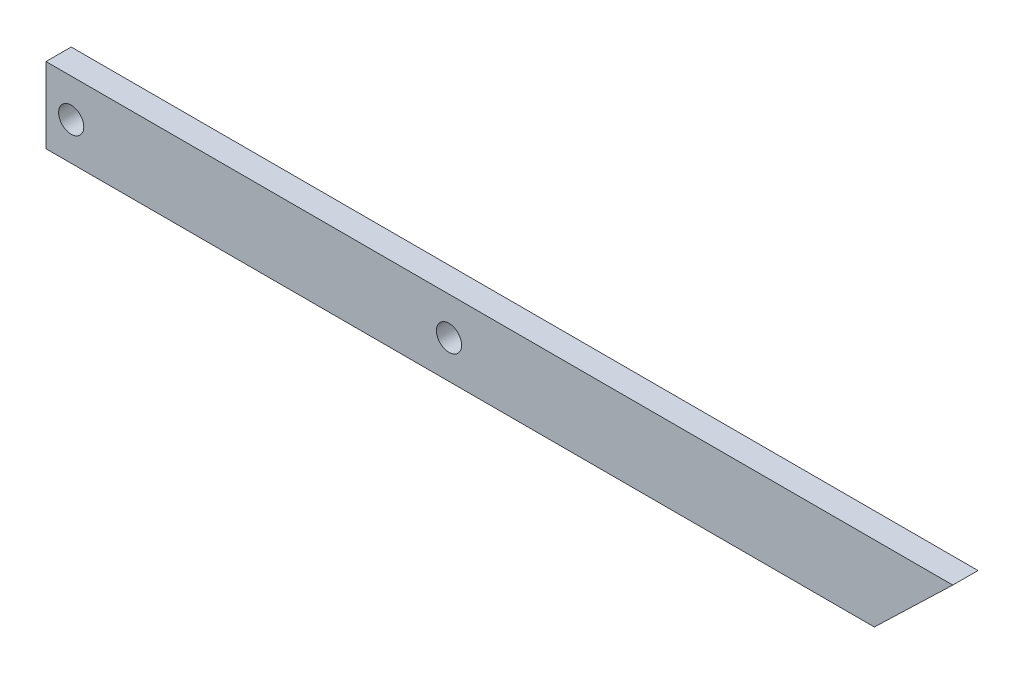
from build123d import *

# Parameters (mm, degrees)
SKIZZE1_R               = 5
LINEAR_AUSTRAGEN1_DEPTH = 10


with BuildPart() as part:
    # Skizze1 → Linear austragen1 (new body)
    with BuildSketch(Plane.XY):
        Polygon((260, 30), (228.842012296, 0), (-100, 0), (-100, 30), align=None)
        with Locations((-90, 15)):
            Circle(SKIZZE1_R, mode=Mode.SUBTRACT)
        with Locations((60, 15)):
            Circle(SKIZZE1_R, mode=Mode.SUBTRACT)
    extrude(amount=LINEAR_AUSTRAGEN1_DEPTH)


solid = part.part
